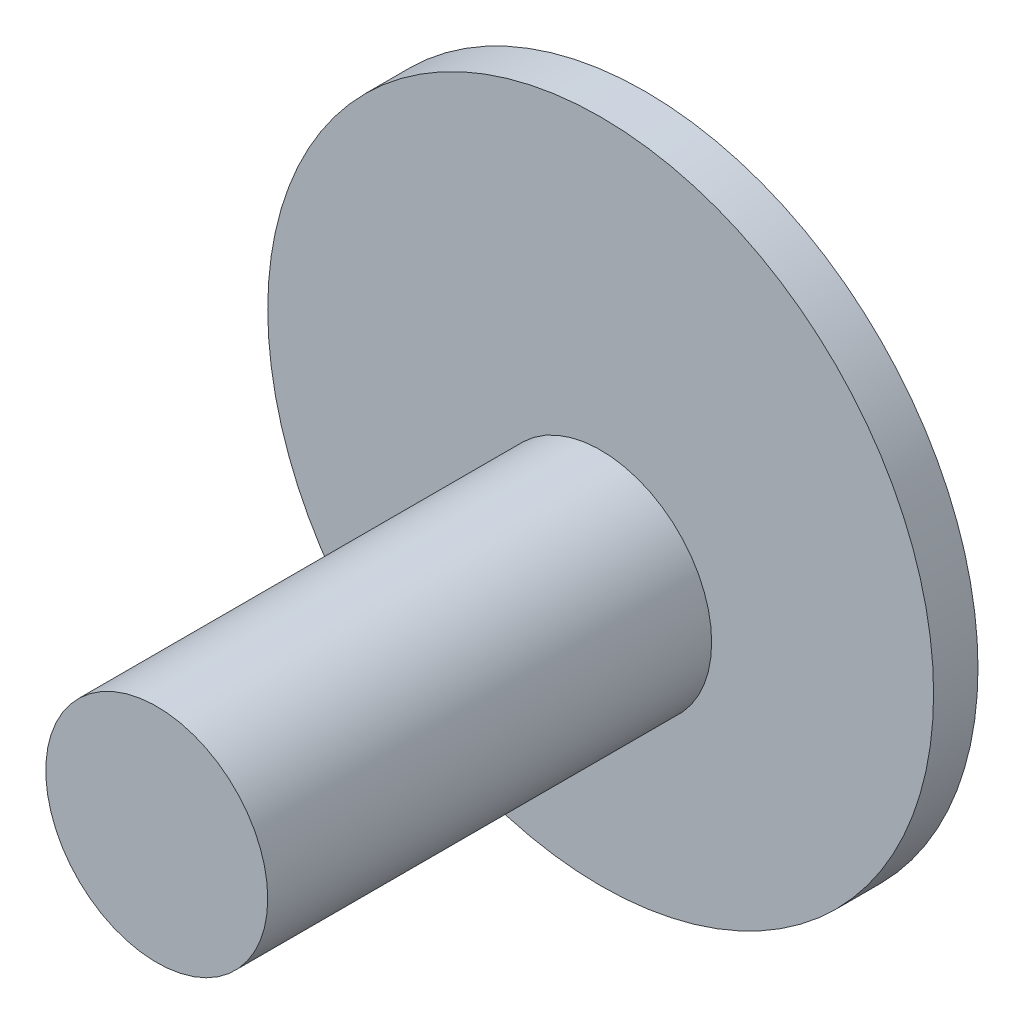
from build123d import *

# Parameters (mm, degrees)
SKIZZE1_R               = 15
LINEAR_AUSTRAGEN1_DEPTH = 2
SKIZZE2_R               = 5
LINEAR_AUSTRAGEN2_DEPTH = 20


with BuildPart() as part:
    # Skizze1 → Linear austragen1 (new body)
    with BuildSketch(Plane.XY):
        Circle(SKIZZE1_R)
    extrude(amount=LINEAR_AUSTRAGEN1_DEPTH)

    # Skizze2 → Linear austragen2 (add)
    with BuildSketch(Plane.XY.offset(2)):
        with Locations((0, -3)):
            Circle(SKIZZE2_R)
    extrude(amount=LINEAR_AUSTRAGEN2_DEPTH)


solid = part.part
